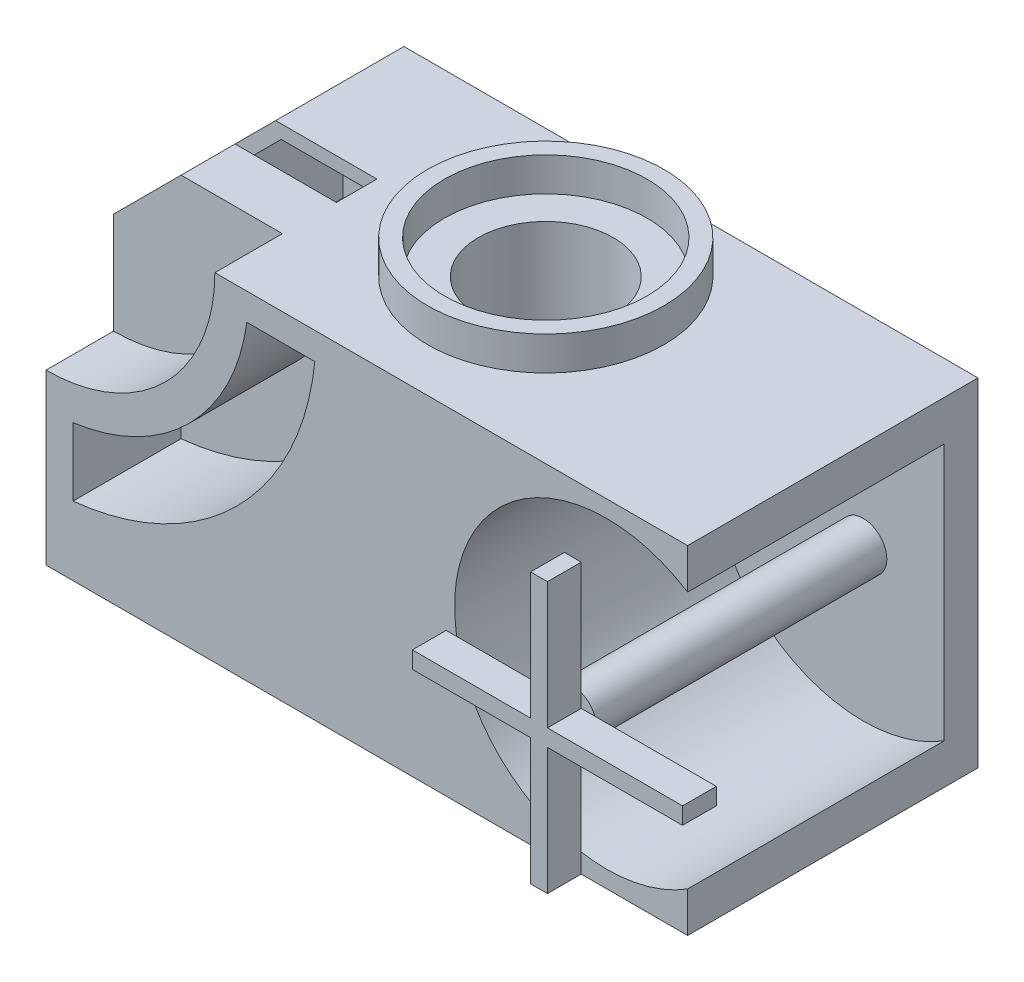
from build123d import *

# Parameters (mm, degrees)
BOSS_EXTRUDE1_DEPTH     = 43
CUT_EXTRUDE1_DEPTH      = 116.646011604
CUT_EXTRUDE1_DEPTH_BACK = 24
CUT_EXTRUDE2_DEPTH      = 16
CHAMFER1_SIZE           = 10
SKETCH5_R               = 22.5
CUT_EXTRUDE3_DEPTH      = 38
SKETCH6_R               = 3.5
BOSS_EXTRUDE2_DEPTH     = 43
SKETCH7_W               = 2.5
SKETCH7_H               = 2.5
BOSS_EXTRUDE3_DEPTH     = 5
SKETCH8_R               = 10
CUT_EXTRUDE4_DEPTH      = 124.357458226
SKETCH9_R               = 17.5
SKETCH9_R_2             = 15
BOSS_EXTRUDE4_DEPTH     = 5
CUT_EXTRUDE5_DEPTH      = 18
BOSS_EXTRUDE5_START     = 6
BOSS_EXTRUDE5_DEPTH     = 8


with BuildPart() as part:
    # Sketch2 → Boss-Extrude1 (new body)
    with BuildSketch(Plane.XY):
        Polygon((0, 0), (63.639702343, 0), (95, 0), (95, 50), (0, 50), align=None)
    extrude(amount=-BOSS_EXTRUDE1_DEPTH)

    # Sketch3 → Cut-Extrude1 (cut, two sides: drawn at the far end of the back side and taken through both)
    with BuildSketch(Plane.XY.offset(-CUT_EXTRUDE1_DEPTH_BACK)):
        with BuildLine():
            Line((-206.468827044, 25), (0, 25))
            ThreePointArc((0, 25), (17.67766953, 32.32233047), (25, 50))
            Line((25, 50), (25, 256.468827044))
            Line((25, 256.468827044), (-266.991015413, 548.459842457))
            Line((-266.991015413, 548.459842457), (-498.459842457, 316.991015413))
            Line((-498.459842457, 316.991015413), (-206.468827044, 25))
        make_face()
    extrude(amount=CUT_EXTRUDE1_DEPTH + CUT_EXTRUDE1_DEPTH_BACK, mode=Mode.SUBTRACT)

    # Sketch4 → Cut-Extrude2 (cut)
    with BuildSketch(Plane.XY):
        with BuildLine():
            Line((29.732137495, 46), (39.799497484, 46))
            ThreePointArc((39.799497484, 46), (28.284271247, 21.715728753), (4, 10.200502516))
            Line((4, 10.200502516), (4, 20.267862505))
            ThreePointArc((4, 20.267862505), (21.213203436, 28.786796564), (29.732137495, 46))
        make_face()
    extrude(amount=-CUT_EXTRUDE2_DEPTH, mode=Mode.SUBTRACT)

    # Chamfer1
    chamfer1_edges = [part.edges().sort_by_distance(p)[0] for p in [
        (0, 50, -33.5),
    ]]
    chamfer(chamfer1_edges, length=CHAMFER1_SIZE)

    # Sketch5 → Cut-Extrude3 (cut)
    with BuildSketch(Plane.XY):
        with Locations((83, 25)):
            Circle(SKETCH5_R)
    extrude(amount=-CUT_EXTRUDE3_DEPTH, mode=Mode.SUBTRACT)

    # Sketch6 → Boss-Extrude2 (add)
    with BuildSketch(Plane.XY.offset(-38)):
        with Locations((83, 25)):
            Circle(SKETCH6_R)
    extrude(amount=BOSS_EXTRUDE2_DEPTH)

    # Sketch7 → Boss-Extrude3 (add)
    with BuildSketch(Plane.XY.offset(5)):
        with BuildLine():
            ThreePointArc((81.75, 21.730825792), (83, 21.5), (84.25, 21.730825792))
            Line((84.25, 21.730825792), (84.25, 23.75))
            Line((84.25, 23.75), (81.75, 23.75))
            Line((81.75, 23.75), (81.75, 21.730825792))
        make_face()
        with BuildLine():
            Line((81.75, 5), (84.25, 5))
            Line((84.25, 5), (84.25, 21.730825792))
            ThreePointArc((84.25, 21.730825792), (83, 21.5), (81.75, 21.730825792))
            Line((81.75, 21.730825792), (81.75, 5))
        make_face()
        with BuildLine():
            Line((64.25, 23.75), (79.730825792, 23.75))
            ThreePointArc((79.730825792, 23.75), (79.5, 25), (79.730825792, 26.25))
            Line((79.730825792, 26.25), (64.25, 26.25))
            Line((64.25, 26.25), (64.25, 23.75))
        make_face()
        with BuildLine():
            Line((79.730825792, 23.75), (81.75, 23.75))
            Line((81.75, 23.75), (81.75, 26.25))
            Line((81.75, 26.25), (79.730825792, 26.25))
            ThreePointArc((79.730825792, 26.25), (79.5, 25), (79.730825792, 23.75))
        make_face()
        with Locations((83, 25)):
            Rectangle(SKETCH7_W, SKETCH7_H)
        with BuildLine():
            Line((84.25, 26.25), (84.25, 23.75))
            Line((84.25, 23.75), (86.269174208, 23.75))
            ThreePointArc((86.269174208, 23.75), (86.441809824, 24.364433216), (86.5, 25))
            ThreePointArc((86.5, 25), (86.441809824, 25.635566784), (86.269174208, 26.25))
            Line((86.269174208, 26.25), (84.25, 26.25))
        make_face()
        with BuildLine():
            ThreePointArc((86.5, 25), (86.441809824, 24.364433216), (86.269174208, 23.75))
            Line((86.269174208, 23.75), (104.25, 23.75))
            Line((104.25, 23.75), (104.25, 26.25))
            Line((104.25, 26.25), (86.269174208, 26.25))
            ThreePointArc((86.269174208, 26.25), (86.441809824, 25.635566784), (86.5, 25))
        make_face()
        with BuildLine():
            Line((81.75, 26.25), (84.25, 26.25))
            Line((84.25, 26.25), (84.25, 28.269174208))
            ThreePointArc((84.25, 28.269174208), (83, 28.5), (81.75, 28.269174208))
            Line((81.75, 28.269174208), (81.75, 26.25))
        make_face()
        with BuildLine():
            ThreePointArc((81.75, 28.269174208), (83, 28.5), (84.25, 28.269174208))
            Line((84.25, 28.269174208), (84.25, 45))
            Line((84.25, 45), (81.75, 45))
            Line((81.75, 45), (81.75, 28.269174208))
        make_face()
    extrude(amount=BOSS_EXTRUDE3_DEPTH)

    # Sketch8 → Cut-Extrude4 (cut, through all)
    with BuildSketch(Plane(origin=(0, 50, 0), x_dir=(1, 0, 0), z_dir=(0, 1, 0))):
        with Locations(Location((50, 24, 0), (0, 0, 180))):
            Circle(SKETCH8_R)
    extrude(amount=-CUT_EXTRUDE4_DEPTH, mode=Mode.SUBTRACT)

    # Sketch9 → Boss-Extrude4 (add)
    with BuildSketch(Plane(origin=(0, 50, 0), x_dir=(1, 0, 0), z_dir=(0, 1, 0))):
        with Locations(Location((50, 24, 0), (0, 0, 180))):
            Circle(SKETCH9_R)
        with Locations(Location((50, 24, 0), (0, 0, 180))):
            Circle(SKETCH9_R_2, mode=Mode.SUBTRACT)
    extrude(amount=BOSS_EXTRUDE4_DEPTH)

    # Sketch10 → Cut-Extrude5 (cut)
    with BuildSketch(Plane.XY.offset(-24)):
        with BuildLine():
            Line((22.912878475, 48), (10.828427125, 48))
            Line((10.828427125, 48), (2, 39.171572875))
            Line((2, 39.171572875), (2, 27.087121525))
            ThreePointArc((2, 27.087121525), (16.263455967, 33.736544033), (22.912878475, 48))
        make_face()
    extrude(amount=-CUT_EXTRUDE5_DEPTH, mode=Mode.SUBTRACT)

    # Sketch11 → Boss-Extrude5 (add)
    with BuildSketch(Plane.XY.offset(-24).offset(BOSS_EXTRUDE5_START)):
        with BuildLine():
            Line((0, 40), (0, 25))
            ThreePointArc((0, 25), (17.67766953, 32.32233047), (25, 50))
            Line((25, 50), (10, 50))
            Line((10, 50), (0, 40))
        make_face()
    extrude(amount=BOSS_EXTRUDE5_DEPTH)


solid = part.part
